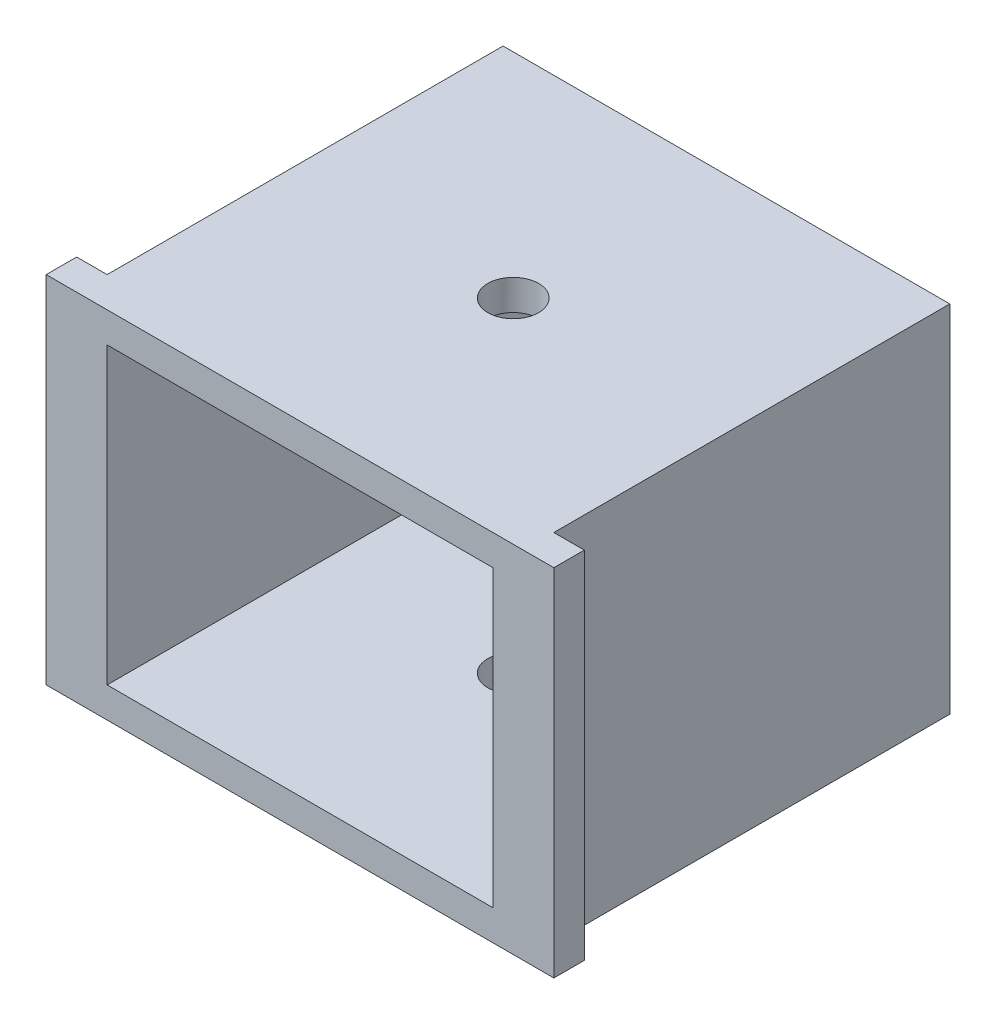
ISO-10303-21;
HEADER;
FILE_DESCRIPTION(('STEP AP214'),'2;1');
FILE_NAME('part.step','',(''),(''),'','','');
FILE_SCHEMA(('AUTOMOTIVE_DESIGN { 1 0 10303 214 1 1 1 1 }'));
ENDSEC;
DATA;
#1=APPLICATION_CONTEXT('core data for automotive mechanical design processes');
#2=APPLICATION_PROTOCOL_DEFINITION('international standard','automotive_design',2000,#1);
#3=PRODUCT_CONTEXT('',#1,'mechanical');
#4=PRODUCT('Part','Part','',(#3));
#5=PRODUCT_RELATED_PRODUCT_CATEGORY('part','',(#4));
#6=PRODUCT_DEFINITION_FORMATION('','',#4);
#7=PRODUCT_DEFINITION_CONTEXT('part definition',#1,'design');
#8=PRODUCT_DEFINITION('design','',#6,#7);
#9=PRODUCT_DEFINITION_SHAPE('','',#8);
#10=(LENGTH_UNIT() NAMED_UNIT(*) SI_UNIT(.MILLI.,.METRE.));
#11=(NAMED_UNIT(*) PLANE_ANGLE_UNIT() SI_UNIT($,.RADIAN.));
#12=(NAMED_UNIT(*) SI_UNIT($,.STERADIAN.) SOLID_ANGLE_UNIT());
#13=UNCERTAINTY_MEASURE_WITH_UNIT(LENGTH_MEASURE(1.E-05),#10,'distance_accuracy_value','');
#14=(GEOMETRIC_REPRESENTATION_CONTEXT(3) GLOBAL_UNCERTAINTY_ASSIGNED_CONTEXT((#13)) GLOBAL_UNIT_ASSIGNED_CONTEXT((#10,
#11,#12)) REPRESENTATION_CONTEXT('',''));
#15=CARTESIAN_POINT('',(0.,0.,0.));
#16=DIRECTION('',(0.,0.,1.));
#17=DIRECTION('',(1.,0.,0.));
#18=AXIS2_PLACEMENT_3D('',#15,#16,#17);
#19=CARTESIAN_POINT('',(50.,35.,42.));
#20=DIRECTION('',(0.,0.,1.));
#21=DIRECTION('',(1.,0.,0.));
#22=AXIS2_PLACEMENT_3D('',#19,#20,#21);
#23=PLANE('',#22);
#24=DIRECTION('',(-1.,0.,0.));
#25=VECTOR('',#24,1.);
#26=CARTESIAN_POINT('',(44.,3.,42.));
#27=LINE('',#26,#25);
#28=CARTESIAN_POINT('',(44.,3.,42.));
#29=VERTEX_POINT('',#28);
#30=CARTESIAN_POINT('',(5.99999999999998,3.,42.));
#31=VERTEX_POINT('',#30);
#32=EDGE_CURVE('E129',#29,#31,#27,.T.);
#33=ORIENTED_EDGE('',*,*,#32,.T.);
#34=DIRECTION('',(0.,1.,0.));
#35=VECTOR('',#34,1.);
#36=CARTESIAN_POINT('',(5.99999999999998,3.,42.));
#37=LINE('',#36,#35);
#38=CARTESIAN_POINT('',(5.99999999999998,32.,42.));
#39=VERTEX_POINT('',#38);
#40=EDGE_CURVE('E138',#31,#39,#37,.T.);
#41=ORIENTED_EDGE('',*,*,#40,.T.);
#42=DIRECTION('',(1.,0.,0.));
#43=VECTOR('',#42,1.);
#44=CARTESIAN_POINT('',(5.99999999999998,32.,42.));
#45=LINE('',#44,#43);
#46=CARTESIAN_POINT('',(44.,32.,42.));
#47=VERTEX_POINT('',#46);
#48=EDGE_CURVE('E53',#39,#47,#45,.T.);
#49=ORIENTED_EDGE('',*,*,#48,.T.);
#50=DIRECTION('',(0.,-1.,0.));
#51=VECTOR('',#50,1.);
#52=CARTESIAN_POINT('',(44.,32.,42.));
#53=LINE('',#52,#51);
#54=EDGE_CURVE('E135',#47,#29,#53,.T.);
#55=ORIENTED_EDGE('',*,*,#54,.T.);
#56=EDGE_LOOP('',(#33,#41,#49,#55));
#57=FACE_BOUND('',#56,.T.);
#58=DIRECTION('',(-1.,0.,0.));
#59=VECTOR('',#58,1.);
#60=CARTESIAN_POINT('',(50.,0.,42.));
#61=LINE('',#60,#59);
#62=CARTESIAN_POINT('',(50.,0.,42.));
#63=VERTEX_POINT('',#62);
#64=CARTESIAN_POINT('',(0.,0.,42.));
#65=VERTEX_POINT('',#64);
#66=EDGE_CURVE('E198',#63,#65,#61,.T.);
#67=ORIENTED_EDGE('',*,*,#66,.F.);
#68=DIRECTION('',(0.,-1.,0.));
#69=VECTOR('',#68,1.);
#70=CARTESIAN_POINT('',(50.,35.,42.));
#71=LINE('',#70,#69);
#72=CARTESIAN_POINT('',(50.,35.,42.));
#73=VERTEX_POINT('',#72);
#74=EDGE_CURVE('E11',#73,#63,#71,.T.);
#75=ORIENTED_EDGE('',*,*,#74,.F.);
#76=DIRECTION('',(-1.,0.,0.));
#77=VECTOR('',#76,1.);
#78=CARTESIAN_POINT('',(50.,35.,42.));
#79=LINE('',#78,#77);
#80=CARTESIAN_POINT('',(0.,35.,42.));
#81=VERTEX_POINT('',#80);
#82=EDGE_CURVE('E203',#73,#81,#79,.T.);
#83=ORIENTED_EDGE('',*,*,#82,.T.);
#84=DIRECTION('',(0.,-1.,0.));
#85=VECTOR('',#84,1.);
#86=CARTESIAN_POINT('',(0.,35.,42.));
#87=LINE('',#86,#85);
#88=EDGE_CURVE('E42',#81,#65,#87,.T.);
#89=ORIENTED_EDGE('',*,*,#88,.T.);
#90=EDGE_LOOP('',(#67,#75,#83,#89));
#91=FACE_BOUND('',#90,.T.);
#92=ADVANCED_FACE('F39',(#57,#91),#23,.T.);
#93=CARTESIAN_POINT('',(50.,35.,0.));
#94=DIRECTION('',(1.,0.,0.));
#95=DIRECTION('',(0.,0.,-1.));
#96=AXIS2_PLACEMENT_3D('',#93,#94,#95);
#97=PLANE('',#96);
#98=DIRECTION('',(0.,1.,0.));
#99=VECTOR('',#98,1.);
#100=CARTESIAN_POINT('',(50.,0.,39.));
#101=LINE('',#100,#99);
#102=CARTESIAN_POINT('',(50.,0.,39.));
#103=VERTEX_POINT('',#102);
#104=CARTESIAN_POINT('',(50.,35.,39.));
#105=VERTEX_POINT('',#104);
#106=EDGE_CURVE('E195',#103,#105,#101,.T.);
#107=ORIENTED_EDGE('',*,*,#106,.T.);
#108=DIRECTION('',(0.,0.,1.));
#109=VECTOR('',#108,1.);
#110=CARTESIAN_POINT('',(50.,35.,0.));
#111=LINE('',#110,#109);
#112=EDGE_CURVE('E212',#105,#73,#111,.T.);
#113=ORIENTED_EDGE('',*,*,#112,.T.);
#114=ORIENTED_EDGE('',*,*,#74,.T.);
#115=DIRECTION('',(0.,0.,1.));
#116=VECTOR('',#115,1.);
#117=CARTESIAN_POINT('',(50.,0.,0.));
#118=LINE('',#117,#116);
#119=EDGE_CURVE('E207',#103,#63,#118,.T.);
#120=ORIENTED_EDGE('',*,*,#119,.F.);
#121=EDGE_LOOP('',(#107,#113,#114,#120));
#122=FACE_BOUND('',#121,.T.);
#123=ADVANCED_FACE('F227',(#122),#97,.T.);
#124=CARTESIAN_POINT('',(0.,35.,0.));
#125=DIRECTION('',(0.,0.,-1.));
#126=DIRECTION('',(-1.,0.,0.));
#127=AXIS2_PLACEMENT_3D('',#124,#125,#126);
#128=PLANE('',#127);
#129=DIRECTION('',(-1.,0.,0.));
#130=VECTOR('',#129,1.);
#131=CARTESIAN_POINT('',(44.,3.,0.));
#132=LINE('',#131,#130);
#133=CARTESIAN_POINT('',(44.,3.,0.));
#134=VERTEX_POINT('',#133);
#135=CARTESIAN_POINT('',(5.99999999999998,3.,0.));
#136=VERTEX_POINT('',#135);
#137=EDGE_CURVE('E61',#134,#136,#132,.T.);
#138=ORIENTED_EDGE('',*,*,#137,.F.);
#139=DIRECTION('',(0.,-1.,0.));
#140=VECTOR('',#139,1.);
#141=CARTESIAN_POINT('',(44.,32.,0.));
#142=LINE('',#141,#140);
#143=CARTESIAN_POINT('',(44.,32.,0.));
#144=VERTEX_POINT('',#143);
#145=EDGE_CURVE('E144',#144,#134,#142,.T.);
#146=ORIENTED_EDGE('',*,*,#145,.F.);
#147=DIRECTION('',(1.,0.,0.));
#148=VECTOR('',#147,1.);
#149=CARTESIAN_POINT('',(5.99999999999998,32.,0.));
#150=LINE('',#149,#148);
#151=CARTESIAN_POINT('',(5.99999999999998,32.,0.));
#152=VERTEX_POINT('',#151);
#153=EDGE_CURVE('E147',#152,#144,#150,.T.);
#154=ORIENTED_EDGE('',*,*,#153,.F.);
#155=DIRECTION('',(0.,1.,0.));
#156=VECTOR('',#155,1.);
#157=CARTESIAN_POINT('',(5.99999999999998,3.,0.));
#158=LINE('',#157,#156);
#159=EDGE_CURVE('E156',#136,#152,#158,.T.);
#160=ORIENTED_EDGE('',*,*,#159,.F.);
#161=EDGE_LOOP('',(#138,#146,#154,#160));
#162=FACE_BOUND('',#161,.T.);
#163=DIRECTION('',(0.,1.,0.));
#164=VECTOR('',#163,1.);
#165=CARTESIAN_POINT('',(3.,0.,0.));
#166=LINE('',#165,#164);
#167=CARTESIAN_POINT('',(3.,0.,0.));
#168=VERTEX_POINT('',#167);
#169=CARTESIAN_POINT('',(3.,35.,0.));
#170=VERTEX_POINT('',#169);
#171=EDGE_CURVE('E177',#168,#170,#166,.T.);
#172=ORIENTED_EDGE('',*,*,#171,.T.);
#173=DIRECTION('',(1.,0.,0.));
#174=VECTOR('',#173,1.);
#175=CARTESIAN_POINT('',(0.,35.,0.));
#176=LINE('',#175,#174);
#177=CARTESIAN_POINT('',(47.,35.,0.));
#178=VERTEX_POINT('',#177);
#179=EDGE_CURVE('E210',#170,#178,#176,.T.);
#180=ORIENTED_EDGE('',*,*,#179,.T.);
#181=DIRECTION('',(0.,1.,0.));
#182=VECTOR('',#181,1.);
#183=CARTESIAN_POINT('',(47.,0.,0.));
#184=LINE('',#183,#182);
#185=CARTESIAN_POINT('',(47.,0.,0.));
#186=VERTEX_POINT('',#185);
#187=EDGE_CURVE('E191',#186,#178,#184,.T.);
#188=ORIENTED_EDGE('',*,*,#187,.F.);
#189=DIRECTION('',(1.,0.,0.));
#190=VECTOR('',#189,1.);
#191=CARTESIAN_POINT('',(0.,0.,0.));
#192=LINE('',#191,#190);
#193=EDGE_CURVE('E219',#168,#186,#192,.T.);
#194=ORIENTED_EDGE('',*,*,#193,.F.);
#195=EDGE_LOOP('',(#172,#180,#188,#194));
#196=FACE_BOUND('',#195,.T.);
#197=ADVANCED_FACE('F245',(#162,#196),#128,.T.);
#198=CARTESIAN_POINT('',(0.,35.,42.));
#199=DIRECTION('',(-1.,0.,0.));
#200=DIRECTION('',(0.,0.,1.));
#201=AXIS2_PLACEMENT_3D('',#198,#199,#200);
#202=PLANE('',#201);
#203=DIRECTION('',(0.,1.,0.));
#204=VECTOR('',#203,1.);
#205=CARTESIAN_POINT('',(0.,0.,39.));
#206=LINE('',#205,#204);
#207=CARTESIAN_POINT('',(0.,0.,39.));
#208=VERTEX_POINT('',#207);
#209=CARTESIAN_POINT('',(0.,35.,39.));
#210=VERTEX_POINT('',#209);
#211=EDGE_CURVE('E173',#208,#210,#206,.T.);
#212=ORIENTED_EDGE('',*,*,#211,.F.);
#213=DIRECTION('',(0.,0.,-1.));
#214=VECTOR('',#213,1.);
#215=CARTESIAN_POINT('',(0.,0.,42.));
#216=LINE('',#215,#214);
#217=EDGE_CURVE('E216',#65,#208,#216,.T.);
#218=ORIENTED_EDGE('',*,*,#217,.F.);
#219=ORIENTED_EDGE('',*,*,#88,.F.);
#220=DIRECTION('',(0.,0.,-1.));
#221=VECTOR('',#220,1.);
#222=CARTESIAN_POINT('',(0.,35.,42.));
#223=LINE('',#222,#221);
#224=EDGE_CURVE('E206',#81,#210,#223,.T.);
#225=ORIENTED_EDGE('',*,*,#224,.T.);
#226=EDGE_LOOP('',(#212,#218,#219,#225));
#227=FACE_BOUND('',#226,.T.);
#228=ADVANCED_FACE('F234',(#227),#202,.T.);
#229=CARTESIAN_POINT('',(0.,35.,0.));
#230=DIRECTION('',(0.,-1.,0.));
#231=DIRECTION('',(0.,0.,-1.));
#232=AXIS2_PLACEMENT_3D('',#229,#230,#231);
#233=PLANE('',#232);
#234=CARTESIAN_POINT('',(25.,35.,21.));
#235=DIRECTION('',(0.,1.,0.));
#236=DIRECTION('',(0.,0.,1.));
#237=AXIS2_PLACEMENT_3D('',#234,#235,#236);
#238=CIRCLE('',#237,2.49999999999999);
#239=CARTESIAN_POINT('',(25.,35.,23.5));
#240=VERTEX_POINT('',#239);
#241=EDGE_CURVE('E287',#240,#240,#238,.T.);
#242=ORIENTED_EDGE('',*,*,#241,.F.);
#243=EDGE_LOOP('',(#242));
#244=FACE_BOUND('',#243,.T.);
#245=ORIENTED_EDGE('',*,*,#179,.F.);
#246=DIRECTION('',(0.,0.,-1.));
#247=VECTOR('',#246,1.);
#248=CARTESIAN_POINT('',(3.,35.,0.));
#249=LINE('',#248,#247);
#250=CARTESIAN_POINT('',(3.,35.,39.));
#251=VERTEX_POINT('',#250);
#252=EDGE_CURVE('E170',#251,#170,#249,.T.);
#253=ORIENTED_EDGE('',*,*,#252,.F.);
#254=DIRECTION('',(1.,0.,0.));
#255=VECTOR('',#254,1.);
#256=CARTESIAN_POINT('',(3.,35.,39.));
#257=LINE('',#256,#255);
#258=EDGE_CURVE('E162',#210,#251,#257,.T.);
#259=ORIENTED_EDGE('',*,*,#258,.F.);
#260=ORIENTED_EDGE('',*,*,#224,.F.);
#261=ORIENTED_EDGE('',*,*,#82,.F.);
#262=ORIENTED_EDGE('',*,*,#112,.F.);
#263=DIRECTION('',(1.,0.,0.));
#264=VECTOR('',#263,1.);
#265=CARTESIAN_POINT('',(47.,35.,39.));
#266=LINE('',#265,#264);
#267=CARTESIAN_POINT('',(47.,35.,39.));
#268=VERTEX_POINT('',#267);
#269=EDGE_CURVE('E188',#268,#105,#266,.T.);
#270=ORIENTED_EDGE('',*,*,#269,.F.);
#271=DIRECTION('',(0.,0.,1.));
#272=VECTOR('',#271,1.);
#273=CARTESIAN_POINT('',(47.,35.,0.));
#274=LINE('',#273,#272);
#275=EDGE_CURVE('E180',#178,#268,#274,.T.);
#276=ORIENTED_EDGE('',*,*,#275,.F.);
#277=EDGE_LOOP('',(#245,#253,#259,#260,#261,#262,#270,#276));
#278=FACE_BOUND('',#277,.T.);
#279=ADVANCED_FACE('F249',(#244,#278),#233,.F.);
#280=CARTESIAN_POINT('',(0.,0.,0.));
#281=DIRECTION('',(0.,-1.,0.));
#282=DIRECTION('',(0.,0.,-1.));
#283=AXIS2_PLACEMENT_3D('',#280,#281,#282);
#284=PLANE('',#283);
#285=CARTESIAN_POINT('',(25.,0.,21.));
#286=DIRECTION('',(0.,-1.,0.));
#287=DIRECTION('',(0.,0.,-1.));
#288=AXIS2_PLACEMENT_3D('',#285,#286,#287);
#289=CIRCLE('',#288,2.49999999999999);
#290=CARTESIAN_POINT('',(25.,0.,18.5));
#291=VERTEX_POINT('',#290);
#292=EDGE_CURVE('E292',#291,#291,#289,.T.);
#293=ORIENTED_EDGE('',*,*,#292,.F.);
#294=EDGE_LOOP('',(#293));
#295=FACE_BOUND('',#294,.T.);
#296=DIRECTION('',(0.,0.,-1.));
#297=VECTOR('',#296,1.);
#298=CARTESIAN_POINT('',(3.,0.,0.));
#299=LINE('',#298,#297);
#300=CARTESIAN_POINT('',(3.,0.,39.));
#301=VERTEX_POINT('',#300);
#302=EDGE_CURVE('E169',#301,#168,#299,.T.);
#303=ORIENTED_EDGE('',*,*,#302,.T.);
#304=ORIENTED_EDGE('',*,*,#193,.T.);
#305=DIRECTION('',(0.,0.,1.));
#306=VECTOR('',#305,1.);
#307=CARTESIAN_POINT('',(47.,0.,0.));
#308=LINE('',#307,#306);
#309=CARTESIAN_POINT('',(47.,0.,39.));
#310=VERTEX_POINT('',#309);
#311=EDGE_CURVE('E184',#186,#310,#308,.T.);
#312=ORIENTED_EDGE('',*,*,#311,.T.);
#313=DIRECTION('',(1.,0.,0.));
#314=VECTOR('',#313,1.);
#315=CARTESIAN_POINT('',(47.,0.,39.));
#316=LINE('',#315,#314);
#317=EDGE_CURVE('E187',#310,#103,#316,.T.);
#318=ORIENTED_EDGE('',*,*,#317,.T.);
#319=ORIENTED_EDGE('',*,*,#119,.T.);
#320=ORIENTED_EDGE('',*,*,#66,.T.);
#321=ORIENTED_EDGE('',*,*,#217,.T.);
#322=DIRECTION('',(1.,0.,0.));
#323=VECTOR('',#322,1.);
#324=CARTESIAN_POINT('',(3.,0.,39.));
#325=LINE('',#324,#323);
#326=EDGE_CURVE('E166',#208,#301,#325,.T.);
#327=ORIENTED_EDGE('',*,*,#326,.T.);
#328=EDGE_LOOP('',(#303,#304,#312,#318,#319,#320,#321,#327));
#329=FACE_BOUND('',#328,.T.);
#330=ADVANCED_FACE('F223',(#295,#329),#284,.T.);
#331=CARTESIAN_POINT('',(47.,0.,39.));
#332=DIRECTION('',(0.,0.,1.));
#333=DIRECTION('',(1.,0.,0.));
#334=AXIS2_PLACEMENT_3D('',#331,#332,#333);
#335=PLANE('',#334);
#336=ORIENTED_EDGE('',*,*,#269,.T.);
#337=ORIENTED_EDGE('',*,*,#106,.F.);
#338=ORIENTED_EDGE('',*,*,#317,.F.);
#339=DIRECTION('',(0.,1.,0.));
#340=VECTOR('',#339,1.);
#341=CARTESIAN_POINT('',(47.,0.,39.));
#342=LINE('',#341,#340);
#343=EDGE_CURVE('E199',#310,#268,#342,.T.);
#344=ORIENTED_EDGE('',*,*,#343,.T.);
#345=EDGE_LOOP('',(#336,#337,#338,#344));
#346=FACE_BOUND('',#345,.T.);
#347=ADVANCED_FACE('F256',(#346),#335,.F.);
#348=CARTESIAN_POINT('',(47.,0.,0.));
#349=DIRECTION('',(-1.,0.,0.));
#350=DIRECTION('',(0.,0.,1.));
#351=AXIS2_PLACEMENT_3D('',#348,#349,#350);
#352=PLANE('',#351);
#353=ORIENTED_EDGE('',*,*,#275,.T.);
#354=ORIENTED_EDGE('',*,*,#343,.F.);
#355=ORIENTED_EDGE('',*,*,#311,.F.);
#356=ORIENTED_EDGE('',*,*,#187,.T.);
#357=EDGE_LOOP('',(#353,#354,#355,#356));
#358=FACE_BOUND('',#357,.T.);
#359=ADVANCED_FACE('F253',(#358),#352,.F.);
#360=CARTESIAN_POINT('',(3.,0.,0.));
#361=DIRECTION('',(1.,0.,0.));
#362=DIRECTION('',(0.,0.,-1.));
#363=AXIS2_PLACEMENT_3D('',#360,#361,#362);
#364=PLANE('',#363);
#365=ORIENTED_EDGE('',*,*,#252,.T.);
#366=ORIENTED_EDGE('',*,*,#171,.F.);
#367=ORIENTED_EDGE('',*,*,#302,.F.);
#368=DIRECTION('',(0.,1.,0.));
#369=VECTOR('',#368,1.);
#370=CARTESIAN_POINT('',(3.,0.,39.));
#371=LINE('',#370,#369);
#372=EDGE_CURVE('E181',#301,#251,#371,.T.);
#373=ORIENTED_EDGE('',*,*,#372,.T.);
#374=EDGE_LOOP('',(#365,#366,#367,#373));
#375=FACE_BOUND('',#374,.T.);
#376=ADVANCED_FACE('F242',(#375),#364,.F.);
#377=CARTESIAN_POINT('',(3.,0.,39.));
#378=DIRECTION('',(0.,0.,1.));
#379=DIRECTION('',(1.,0.,0.));
#380=AXIS2_PLACEMENT_3D('',#377,#378,#379);
#381=PLANE('',#380);
#382=ORIENTED_EDGE('',*,*,#258,.T.);
#383=ORIENTED_EDGE('',*,*,#372,.F.);
#384=ORIENTED_EDGE('',*,*,#326,.F.);
#385=ORIENTED_EDGE('',*,*,#211,.T.);
#386=EDGE_LOOP('',(#382,#383,#384,#385));
#387=FACE_BOUND('',#386,.T.);
#388=ADVANCED_FACE('F238',(#387),#381,.F.);
#389=CARTESIAN_POINT('',(44.,3.,42.));
#390=DIRECTION('',(0.,-1.,0.));
#391=DIRECTION('',(1.,0.,0.));
#392=AXIS2_PLACEMENT_3D('',#389,#390,#391);
#393=PLANE('',#392);
#394=CARTESIAN_POINT('',(25.,3.,21.));
#395=DIRECTION('',(0.,-1.,0.));
#396=DIRECTION('',(1.,0.,0.));
#397=AXIS2_PLACEMENT_3D('',#394,#395,#396);
#398=CIRCLE('',#397,2.49999999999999);
#399=CARTESIAN_POINT('',(27.5,3.,21.));
#400=VERTEX_POINT('',#399);
#401=EDGE_CURVE('E289',#400,#400,#398,.T.);
#402=ORIENTED_EDGE('',*,*,#401,.T.);
#403=EDGE_LOOP('',(#402));
#404=FACE_BOUND('',#403,.T.);
#405=ORIENTED_EDGE('',*,*,#137,.T.);
#406=DIRECTION('',(0.,0.,-1.));
#407=VECTOR('',#406,1.);
#408=CARTESIAN_POINT('',(5.99999999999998,3.,42.));
#409=LINE('',#408,#407);
#410=EDGE_CURVE('E125',#31,#136,#409,.T.);
#411=ORIENTED_EDGE('',*,*,#410,.F.);
#412=ORIENTED_EDGE('',*,*,#32,.F.);
#413=DIRECTION('',(0.,0.,-1.));
#414=VECTOR('',#413,1.);
#415=CARTESIAN_POINT('',(44.,3.,42.));
#416=LINE('',#415,#414);
#417=EDGE_CURVE('E160',#29,#134,#416,.T.);
#418=ORIENTED_EDGE('',*,*,#417,.T.);
#419=EDGE_LOOP('',(#405,#411,#412,#418));
#420=FACE_BOUND('',#419,.T.);
#421=ADVANCED_FACE('F127',(#404,#420),#393,.F.);
#422=CARTESIAN_POINT('',(44.,32.,42.));
#423=DIRECTION('',(1.,0.,0.));
#424=DIRECTION('',(0.,0.,-1.));
#425=AXIS2_PLACEMENT_3D('',#422,#423,#424);
#426=PLANE('',#425);
#427=ORIENTED_EDGE('',*,*,#145,.T.);
#428=ORIENTED_EDGE('',*,*,#417,.F.);
#429=ORIENTED_EDGE('',*,*,#54,.F.);
#430=DIRECTION('',(0.,0.,-1.));
#431=VECTOR('',#430,1.);
#432=CARTESIAN_POINT('',(44.,32.,42.));
#433=LINE('',#432,#431);
#434=EDGE_CURVE('E163',#47,#144,#433,.T.);
#435=ORIENTED_EDGE('',*,*,#434,.T.);
#436=EDGE_LOOP('',(#427,#428,#429,#435));
#437=FACE_BOUND('',#436,.T.);
#438=ADVANCED_FACE('F306',(#437),#426,.F.);
#439=CARTESIAN_POINT('',(5.99999999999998,32.,42.));
#440=DIRECTION('',(0.,1.,0.));
#441=DIRECTION('',(-1.,0.,0.));
#442=AXIS2_PLACEMENT_3D('',#439,#440,#441);
#443=PLANE('',#442);
#444=CARTESIAN_POINT('',(25.,32.,21.));
#445=DIRECTION('',(0.,1.,0.));
#446=DIRECTION('',(-1.,0.,0.));
#447=AXIS2_PLACEMENT_3D('',#444,#445,#446);
#448=CIRCLE('',#447,2.49999999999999);
#449=CARTESIAN_POINT('',(22.5,32.,21.));
#450=VERTEX_POINT('',#449);
#451=EDGE_CURVE('E150',#450,#450,#448,.T.);
#452=ORIENTED_EDGE('',*,*,#451,.T.);
#453=EDGE_LOOP('',(#452));
#454=FACE_BOUND('',#453,.T.);
#455=ORIENTED_EDGE('',*,*,#153,.T.);
#456=ORIENTED_EDGE('',*,*,#434,.F.);
#457=ORIENTED_EDGE('',*,*,#48,.F.);
#458=DIRECTION('',(0.,0.,-1.));
#459=VECTOR('',#458,1.);
#460=CARTESIAN_POINT('',(5.99999999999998,32.,42.));
#461=LINE('',#460,#459);
#462=EDGE_CURVE('E134',#39,#152,#461,.T.);
#463=ORIENTED_EDGE('',*,*,#462,.T.);
#464=EDGE_LOOP('',(#455,#456,#457,#463));
#465=FACE_BOUND('',#464,.T.);
#466=ADVANCED_FACE('F312',(#454,#465),#443,.F.);
#467=CARTESIAN_POINT('',(5.99999999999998,3.,42.));
#468=DIRECTION('',(-1.,0.,0.));
#469=DIRECTION('',(0.,0.,1.));
#470=AXIS2_PLACEMENT_3D('',#467,#468,#469);
#471=PLANE('',#470);
#472=ORIENTED_EDGE('',*,*,#159,.T.);
#473=ORIENTED_EDGE('',*,*,#462,.F.);
#474=ORIENTED_EDGE('',*,*,#40,.F.);
#475=ORIENTED_EDGE('',*,*,#410,.T.);
#476=EDGE_LOOP('',(#472,#473,#474,#475));
#477=FACE_BOUND('',#476,.T.);
#478=ADVANCED_FACE('F139',(#477),#471,.F.);
#479=CARTESIAN_POINT('',(25.,35.,21.));
#480=DIRECTION('',(0.,1.,0.));
#481=DIRECTION('',(0.,0.,1.));
#482=AXIS2_PLACEMENT_3D('',#479,#480,#481);
#483=CYLINDRICAL_SURFACE('',#482,2.49999999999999);
#484=ORIENTED_EDGE('',*,*,#451,.F.);
#485=EDGE_LOOP('',(#484));
#486=FACE_BOUND('',#485,.T.);
#487=ORIENTED_EDGE('',*,*,#241,.T.);
#488=EDGE_LOOP('',(#487));
#489=FACE_BOUND('',#488,.T.);
#490=ADVANCED_FACE('F301',(#486,#489),#483,.F.);
#491=CARTESIAN_POINT('',(25.,0.,21.));
#492=DIRECTION('',(0.,-1.,0.));
#493=DIRECTION('',(0.,0.,-1.));
#494=AXIS2_PLACEMENT_3D('',#491,#492,#493);
#495=CYLINDRICAL_SURFACE('',#494,2.49999999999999);
#496=ORIENTED_EDGE('',*,*,#292,.T.);
#497=EDGE_LOOP('',(#496));
#498=FACE_BOUND('',#497,.T.);
#499=ORIENTED_EDGE('',*,*,#401,.F.);
#500=EDGE_LOOP('',(#499));
#501=FACE_BOUND('',#500,.T.);
#502=ADVANCED_FACE('F298',(#498,#501),#495,.F.);
#503=CLOSED_SHELL('',(#92,#123,#197,#228,#279,#330,#347,#359,#376,#388,#421,#438,#466,#478,#490,#502));
#504=MANIFOLD_SOLID_BREP('B2',#503);
#505=ADVANCED_BREP_SHAPE_REPRESENTATION('',(#18,#504),#14);
#506=SHAPE_DEFINITION_REPRESENTATION(#9,#505);
ENDSEC;
END-ISO-10303-21;
